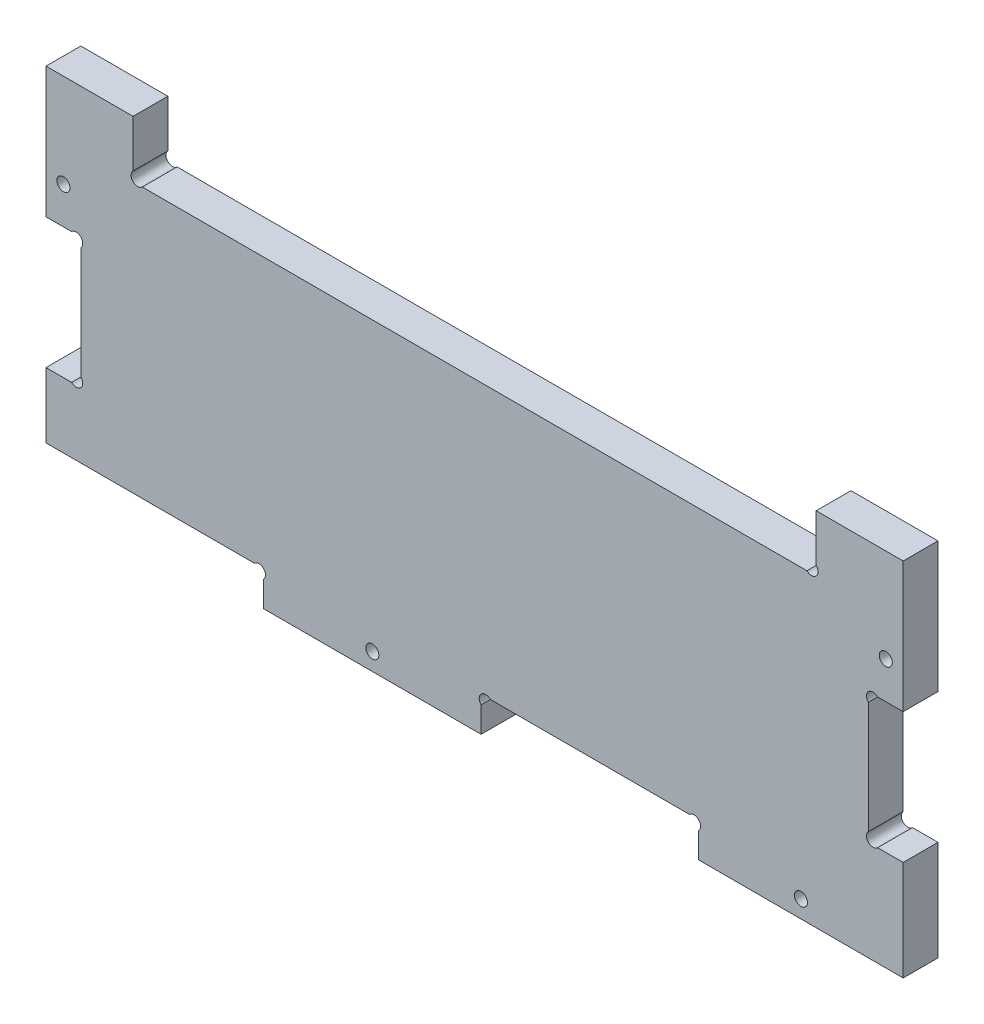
from build123d import *

# Parameters (mm, degrees)
ESQUISSE1_R        = 1.5
BOSS_EXTRU_1_DEPTH = 8


with BuildPart() as part:
    # Esquisse1 → Boss.-Extru.1 (new body)
    with BuildSketch(Plane.XY):
        with BuildLine():
            Line((-176.815675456, 28.383111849), (-176.815675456, 45.383111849))
            Line((-176.815675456, 45.383111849), (-176.815675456, 58.383111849))
            Line((-176.815675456, 58.383111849), (-156.815675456, 58.383111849))
            Line((-156.815675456, 58.383111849), (-156.815675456, 47.504432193))
            ThreePointArc((-156.815675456, 47.504432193), (-156.815675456, 45.383111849), (-154.694355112, 45.383111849))
            Line((-154.694355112, 45.383111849), (-1.936995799, 45.383111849))
            ThreePointArc((-1.936995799, 45.383111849), (0.184324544, 45.383111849), (0.184324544, 47.504432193))
            Line((0.184324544, 47.504432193), (0.184324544, 58.383111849))
            Line((0.184324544, 58.383111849), (20.184324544, 58.383111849))
            Line((20.184324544, 58.383111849), (20.184324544, 45.383111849))
            Line((20.184324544, 45.383111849), (20.184324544, 28.383111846))
            Line((20.184324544, 28.383111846), (14.305644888, 28.383111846))
            ThreePointArc((14.305644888, 28.383111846), (12.184324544, 28.383111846), (12.184324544, 26.261791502))
            Line((12.184324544, 26.261791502), (12.184324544, 0.50443219))
            ThreePointArc((12.184324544, 0.50443219), (12.184324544, -1.616888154), (14.305644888, -1.616888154))
            Line((14.305644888, -1.616888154), (20.184324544, -1.616888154))
            Line((20.184324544, -1.616888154), (20.184324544, -16.616888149))
            Line((20.184324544, -16.616888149), (20.184324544, -18.738208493))
            Line((20.184324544, -18.738208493), (20.184324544, -24.616888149))
            Line((20.184324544, -24.616888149), (-26.815675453, -24.616888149))
            Line((-26.815675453, -24.616888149), (-26.815675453, -18.738208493))
            ThreePointArc((-26.815675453, -18.738208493), (-26.815675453, -16.616888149), (-28.936995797, -16.616888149))
            Line((-28.936995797, -16.616888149), (-74.69435511, -16.616888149))
            ThreePointArc((-74.69435511, -16.616888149), (-76.815675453, -16.616888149), (-76.815675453, -18.738208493))
            Line((-76.815675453, -18.738208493), (-76.815675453, -24.616888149))
            Line((-76.815675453, -24.616888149), (-126.815675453, -24.616888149))
            Line((-126.815675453, -24.616888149), (-126.815675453, -18.738208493))
            ThreePointArc((-126.815675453, -18.738208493), (-126.815675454, -16.61688815), (-128.936995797, -16.616888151))
            Line((-128.936995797, -16.616888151), (-176.815675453, -16.616888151))
            Line((-176.815675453, -16.616888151), (-176.815675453, -1.616888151))
            Line((-176.815675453, -1.616888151), (-170.936995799, -1.616888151))
            ThreePointArc((-170.936995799, -1.616888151), (-168.815675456, -1.616888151), (-168.815675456, 0.504432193))
            Line((-168.815675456, 0.504432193), (-168.815675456, 26.261791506))
            ThreePointArc((-168.815675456, 26.261791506), (-168.815675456, 28.383111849), (-170.936995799, 28.383111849))
            Line((-170.936995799, 28.383111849), (-176.815675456, 28.383111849))
        make_face()
        with Locations((-101.815675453, -20.616888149)):
            Circle(ESQUISSE1_R, mode=Mode.SUBTRACT)
        with Locations((-3.315675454, -20.616888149)):
            Circle(ESQUISSE1_R, mode=Mode.SUBTRACT)
        with Locations((-172.815675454, 36.883111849)):
            Circle(ESQUISSE1_R, mode=Mode.SUBTRACT)
        with Locations((16.184324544, 36.883111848)):
            Circle(ESQUISSE1_R, mode=Mode.SUBTRACT)
    extrude(amount=BOSS_EXTRU_1_DEPTH)


solid = part.part
